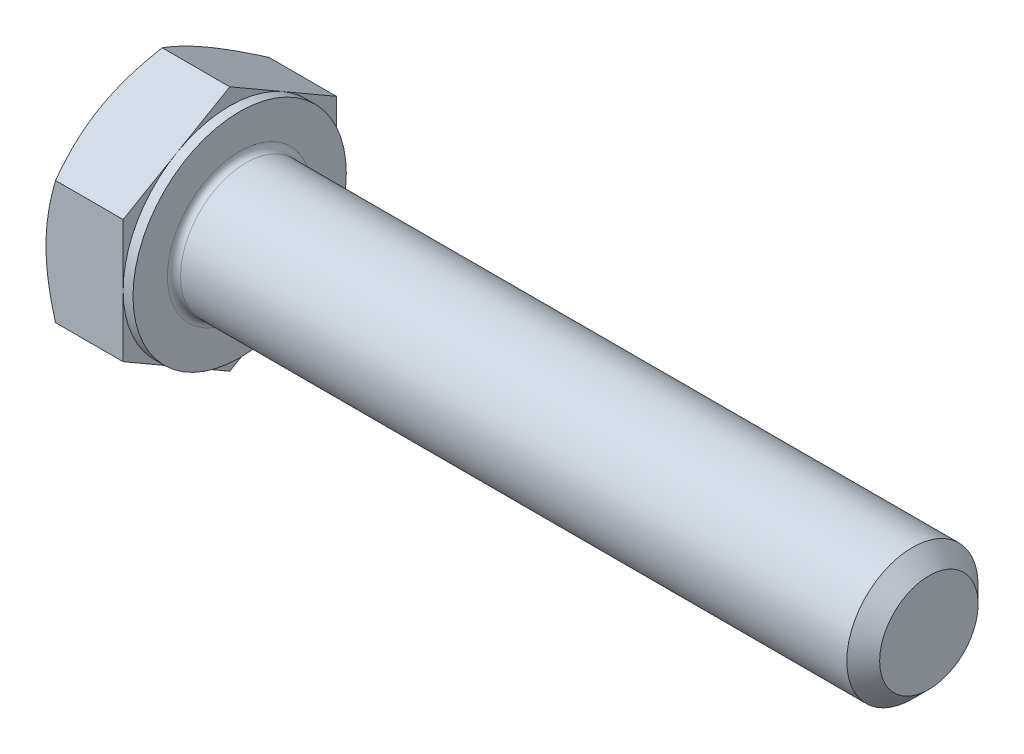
ISO-10303-21;
HEADER;
FILE_DESCRIPTION(('STEP AP214'),'2;1');
FILE_NAME('part.step','',(''),(''),'','','');
FILE_SCHEMA(('AUTOMOTIVE_DESIGN { 1 0 10303 214 1 1 1 1 }'));
ENDSEC;
DATA;
#1=APPLICATION_CONTEXT('core data for automotive mechanical design processes');
#2=APPLICATION_PROTOCOL_DEFINITION('international standard','automotive_design',2000,#1);
#3=PRODUCT_CONTEXT('',#1,'mechanical');
#4=PRODUCT('Part','Part','',(#3));
#5=PRODUCT_RELATED_PRODUCT_CATEGORY('part','',(#4));
#6=PRODUCT_DEFINITION_FORMATION('','',#4);
#7=PRODUCT_DEFINITION_CONTEXT('part definition',#1,'design');
#8=PRODUCT_DEFINITION('design','',#6,#7);
#9=PRODUCT_DEFINITION_SHAPE('','',#8);
#10=(LENGTH_UNIT() NAMED_UNIT(*) SI_UNIT(.MILLI.,.METRE.));
#11=(NAMED_UNIT(*) PLANE_ANGLE_UNIT() SI_UNIT($,.RADIAN.));
#12=(NAMED_UNIT(*) SI_UNIT($,.STERADIAN.) SOLID_ANGLE_UNIT());
#13=UNCERTAINTY_MEASURE_WITH_UNIT(LENGTH_MEASURE(1.E-05),#10,'distance_accuracy_value','');
#14=(GEOMETRIC_REPRESENTATION_CONTEXT(3) GLOBAL_UNCERTAINTY_ASSIGNED_CONTEXT((#13)) GLOBAL_UNIT_ASSIGNED_CONTEXT((#10,
#11,#12)) REPRESENTATION_CONTEXT('',''));
#15=CARTESIAN_POINT('',(0.,0.,0.));
#16=DIRECTION('',(0.,0.,1.));
#17=DIRECTION('',(1.,0.,0.));
#18=AXIS2_PLACEMENT_3D('',#15,#16,#17);
#19=CARTESIAN_POINT('',(5.3,3.75277674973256,-6.5));
#20=DIRECTION('',(0.,-0.866025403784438,0.500000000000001));
#21=DIRECTION('',(0.,-0.500000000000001,-0.866025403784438));
#22=AXIS2_PLACEMENT_3D('',#19,#20,#21);
#23=PLANE('',#22);
#24=DIRECTION('',(0.,0.500000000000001,0.866025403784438));
#25=VECTOR('',#24,1.);
#26=CARTESIAN_POINT('',(4.7,3.75277674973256,-6.5));
#27=LINE('',#26,#25);
#28=CARTESIAN_POINT('',(4.7,3.75277674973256,-6.5));
#29=VERTEX_POINT('',#28);
#30=CARTESIAN_POINT('',(4.7,5.62916512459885,-3.25000000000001));
#31=VERTEX_POINT('',#30);
#32=EDGE_CURVE('E173',#29,#31,#27,.T.);
#33=ORIENTED_EDGE('',*,*,#32,.F.);
#34=DIRECTION('',(-1.,0.,0.));
#35=VECTOR('',#34,1.);
#36=CARTESIAN_POINT('',(5.3,3.75277674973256,-6.5));
#37=LINE('',#36,#35);
#38=CARTESIAN_POINT('',(0.580556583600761,3.75277674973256,-6.5));
#39=VERTEX_POINT('',#38);
#40=EDGE_CURVE('E301',#29,#39,#37,.T.);
#41=ORIENTED_EDGE('',*,*,#40,.T.);
#42=CARTESIAN_POINT('',(0.580623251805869,7.50566896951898,0.000200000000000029));
#43=CARTESIAN_POINT('',(0.533004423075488,7.4231786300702,-0.14267745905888));
#44=CARTESIAN_POINT('',(0.487546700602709,7.34038072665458,-0.286087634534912));
#45=CARTESIAN_POINT('',(0.401548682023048,7.17411251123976,-0.574072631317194));
#46=CARTESIAN_POINT('',(0.361010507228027,7.09064192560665,-0.718647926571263));
#47=CARTESIAN_POINT('',(0.24757100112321,6.83889369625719,-1.15468865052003));
#48=CARTESIAN_POINT('',(0.183047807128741,6.66962231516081,-1.44787528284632));
#49=CARTESIAN_POINT('',(0.107386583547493,6.41631077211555,-1.88662374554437));
#50=CARTESIAN_POINT('',(0.0858328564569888,6.33302748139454,-2.03087463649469));
#51=CARTESIAN_POINT('',(0.04969031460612,6.16608458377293,-2.32002821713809));
#52=CARTESIAN_POINT('',(0.0351008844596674,6.08242501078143,-2.46493084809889));
#53=CARTESIAN_POINT('',(0.0132587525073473,5.91496056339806,-2.75498777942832));
#54=CARTESIAN_POINT('',(0.0059977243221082,5.8311559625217,-2.90014160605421));
#55=CARTESIAN_POINT('',(-0.00103969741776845,5.66347396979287,-3.19057533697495));
#56=CARTESIAN_POINT('',(-0.000816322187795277,5.5795965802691,-3.33585523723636));
#57=CARTESIAN_POINT('',(0.010083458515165,5.34979921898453,-3.73387594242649));
#58=CARTESIAN_POINT('',(0.0283818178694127,5.20395446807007,-3.98648646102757));
#59=CARTESIAN_POINT('',(0.0864063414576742,4.91323365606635,-4.49002967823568));
#60=CARTESIAN_POINT('',(0.126152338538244,4.76835861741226,-4.74096060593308));
#61=CARTESIAN_POINT('',(0.225505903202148,4.47705272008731,-5.24551722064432));
#62=CARTESIAN_POINT('',(0.285534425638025,4.33065861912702,-5.49907924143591));
#63=CARTESIAN_POINT('',(0.421774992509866,4.04005357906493,-6.00242193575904));
#64=CARTESIAN_POINT('',(0.49795503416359,3.89583891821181,-6.25220905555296));
#65=CARTESIAN_POINT('',(0.580623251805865,3.75266127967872,-6.5002));
#66=B_SPLINE_CURVE_WITH_KNOTS('',3,(#42,#43,#44,#45,#46,#47,#48,#49,#50,#51,#52,#53,#54,#55,#56,
#57,#58,#59,#60,#61,#62,#63,#64,#65),.UNSPECIFIED.,.F.,.F.,(4,2,2,2,2,2,2,2,2,2,2,4),(0.,
0.515105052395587,1.03043143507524,2.06322554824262,2.56697389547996,3.07067772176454,
3.57380860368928,4.0769239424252,4.9527935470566,5.82947446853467,6.72559912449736,
7.61996451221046),.UNSPECIFIED.);
#67=CARTESIAN_POINT('',(0.,5.62916512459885,-3.25000000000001));
#68=VERTEX_POINT('',#67);
#69=EDGE_CURVE('E228',#68,#39,#66,.T.);
#70=ORIENTED_EDGE('',*,*,#69,.F.);
#71=CARTESIAN_POINT('',(0.580556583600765,7.50555349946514,0.));
#72=VERTEX_POINT('',#71);
#73=EDGE_CURVE('E64',#72,#68,#66,.T.);
#74=ORIENTED_EDGE('',*,*,#73,.F.);
#75=DIRECTION('',(-1.,0.,0.));
#76=VECTOR('',#75,1.);
#77=CARTESIAN_POINT('',(5.3,7.50555349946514,0.));
#78=LINE('',#77,#76);
#79=CARTESIAN_POINT('',(4.7,7.50555349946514,0.));
#80=VERTEX_POINT('',#79);
#81=EDGE_CURVE('E293',#80,#72,#78,.T.);
#82=ORIENTED_EDGE('',*,*,#81,.F.);
#83=EDGE_CURVE('E171',#31,#80,#27,.T.);
#84=ORIENTED_EDGE('',*,*,#83,.F.);
#85=EDGE_LOOP('',(#33,#41,#70,#74,#82,#84));
#86=FACE_BOUND('',#85,.T.);
#87=ADVANCED_FACE('F41',(#86),#23,.F.);
#88=CARTESIAN_POINT('',(5.3,7.50555349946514,0.));
#89=DIRECTION('',(0.,-0.866025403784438,-0.500000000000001));
#90=DIRECTION('',(0.,0.500000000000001,-0.866025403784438));
#91=AXIS2_PLACEMENT_3D('',#88,#89,#90);
#92=PLANE('',#91);
#93=DIRECTION('',(0.,-0.500000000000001,0.866025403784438));
#94=VECTOR('',#93,1.);
#95=CARTESIAN_POINT('',(4.7,7.50555349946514,0.));
#96=LINE('',#95,#94);
#97=CARTESIAN_POINT('',(4.7,5.62916512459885,3.25000000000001));
#98=VERTEX_POINT('',#97);
#99=EDGE_CURVE('E170',#80,#98,#96,.T.);
#100=ORIENTED_EDGE('',*,*,#99,.F.);
#101=ORIENTED_EDGE('',*,*,#81,.T.);
#102=CARTESIAN_POINT('',(0.580623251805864,3.75266127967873,6.50019999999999));
#103=CARTESIAN_POINT('',(0.533004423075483,3.83515161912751,6.35732254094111));
#104=CARTESIAN_POINT('',(0.487546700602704,3.91794952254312,6.21391236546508));
#105=CARTESIAN_POINT('',(0.401548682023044,4.08421773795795,5.9259273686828));
#106=CARTESIAN_POINT('',(0.361010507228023,4.16768832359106,5.78135207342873));
#107=CARTESIAN_POINT('',(0.247571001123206,4.41943655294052,5.34531134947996));
#108=CARTESIAN_POINT('',(0.183047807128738,4.5887079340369,5.05212471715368));
#109=CARTESIAN_POINT('',(0.107386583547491,4.84201947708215,4.61337625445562));
#110=CARTESIAN_POINT('',(0.0858328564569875,4.92530276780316,4.4691253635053));
#111=CARTESIAN_POINT('',(0.0496903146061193,5.09224566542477,4.17997178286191));
#112=CARTESIAN_POINT('',(0.035100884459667,5.17590523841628,4.03506915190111));
#113=CARTESIAN_POINT('',(0.0132587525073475,5.34336968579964,3.74501222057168));
#114=CARTESIAN_POINT('',(0.00599772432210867,5.427174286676,3.59985839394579));
#115=CARTESIAN_POINT('',(-0.00103969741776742,5.59485627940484,3.30942466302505));
#116=CARTESIAN_POINT('',(-0.000816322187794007,5.67873366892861,3.16414476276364));
#117=CARTESIAN_POINT('',(0.0100834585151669,5.90853103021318,2.7661240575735));
#118=CARTESIAN_POINT('',(0.0283818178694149,6.05437578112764,2.51351353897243));
#119=CARTESIAN_POINT('',(0.0864063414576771,6.34509659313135,2.00997032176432));
#120=CARTESIAN_POINT('',(0.126152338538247,6.48997163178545,1.75903939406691));
#121=CARTESIAN_POINT('',(0.225505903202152,6.78127752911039,1.25448277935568));
#122=CARTESIAN_POINT('',(0.285534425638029,6.92767163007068,1.00092075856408));
#123=CARTESIAN_POINT('',(0.421774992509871,7.21827667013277,0.497578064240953));
#124=CARTESIAN_POINT('',(0.497955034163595,7.36249133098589,0.247790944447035));
#125=CARTESIAN_POINT('',(0.58062325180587,7.50566896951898,-0.000200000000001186));
#126=B_SPLINE_CURVE_WITH_KNOTS('',3,(#102,#103,#104,#105,#106,#107,#108,#109,#110,#111,#112,
#113,#114,#115,#116,#117,#118,#119,#120,#121,#122,#123,#124,#125),.UNSPECIFIED.,.F.,.F.,(4,2,2,
2,2,2,2,2,2,2,2,4),(0.,0.515105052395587,1.03043143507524,2.06322554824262,2.56697389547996,
3.07067772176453,3.57380860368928,4.0769239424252,4.9527935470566,5.82947446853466,
6.72559912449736,7.61996451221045),.UNSPECIFIED.);
#127=CARTESIAN_POINT('',(0.,5.62916512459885,3.25));
#128=VERTEX_POINT('',#127);
#129=EDGE_CURVE('E225',#128,#72,#126,.T.);
#130=ORIENTED_EDGE('',*,*,#129,.F.);
#131=CARTESIAN_POINT('',(0.58055658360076,3.75277674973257,6.49999999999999));
#132=VERTEX_POINT('',#131);
#133=EDGE_CURVE('E239',#132,#128,#126,.T.);
#134=ORIENTED_EDGE('',*,*,#133,.F.);
#135=DIRECTION('',(-1.,0.,0.));
#136=VECTOR('',#135,1.);
#137=CARTESIAN_POINT('',(5.3,3.75277674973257,6.49999999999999));
#138=LINE('',#137,#136);
#139=CARTESIAN_POINT('',(4.7,3.75277674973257,6.49999999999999));
#140=VERTEX_POINT('',#139);
#141=EDGE_CURVE('E295',#140,#132,#138,.T.);
#142=ORIENTED_EDGE('',*,*,#141,.F.);
#143=EDGE_CURVE('E138',#98,#140,#96,.T.);
#144=ORIENTED_EDGE('',*,*,#143,.F.);
#145=EDGE_LOOP('',(#100,#101,#130,#134,#142,#144));
#146=FACE_BOUND('',#145,.T.);
#147=ADVANCED_FACE('F246',(#146),#92,.F.);
#148=CARTESIAN_POINT('',(5.3,3.75277674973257,6.49999999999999));
#149=DIRECTION('',(0.,0.,-1.));
#150=DIRECTION('',(0.,1.,0.));
#151=AXIS2_PLACEMENT_3D('',#148,#149,#150);
#152=PLANE('',#151);
#153=DIRECTION('',(0.,-1.,0.));
#154=VECTOR('',#153,1.);
#155=CARTESIAN_POINT('',(4.7,3.75277674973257,6.49999999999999));
#156=LINE('',#155,#154);
#157=CARTESIAN_POINT('',(4.7,0.,6.5));
#158=VERTEX_POINT('',#157);
#159=EDGE_CURVE('E132',#140,#158,#156,.T.);
#160=ORIENTED_EDGE('',*,*,#159,.F.);
#161=ORIENTED_EDGE('',*,*,#141,.T.);
#162=CARTESIAN_POINT('',(3.18835311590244,-10.1137456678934,6.5));
#163=CARTESIAN_POINT('',(3.05034774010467,-9.82952666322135,6.5));
#164=CARTESIAN_POINT('',(2.91365616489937,-9.54465869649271,6.5));
#165=CARTESIAN_POINT('',(2.6436389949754,-8.97327978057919,6.5));
#166=CARTESIAN_POINT('',(2.51031392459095,-8.6867685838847,6.5));
#167=CARTESIAN_POINT('',(2.24710473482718,-8.11029837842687,6.5));
#168=CARTESIAN_POINT('',(2.11724300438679,-7.82032911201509,6.5));
#169=CARTESIAN_POINT('',(1.86279082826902,-7.23809541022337,6.5));
#170=CARTESIAN_POINT('',(1.73820013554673,-6.94583108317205,6.5));
#171=CARTESIAN_POINT('',(1.4917668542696,-6.34906440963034,6.5));
#172=CARTESIAN_POINT('',(1.37014257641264,-6.0444714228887,6.5));
#173=CARTESIAN_POINT('',(1.13601865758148,-5.43173420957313,6.5));
#174=CARTESIAN_POINT('',(1.02352003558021,-5.12358959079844,6.5));
#175=CARTESIAN_POINT('',(0.81057536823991,-4.50382569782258,6.5));
#176=CARTESIAN_POINT('',(0.710105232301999,-4.19221478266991,6.5));
#177=CARTESIAN_POINT('',(0.524420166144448,-3.5645201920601,6.5));
#178=CARTESIAN_POINT('',(0.439200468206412,-3.24843794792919,6.5));
#179=CARTESIAN_POINT('',(0.288524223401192,-2.61335465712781,6.5));
#180=CARTESIAN_POINT('',(0.222961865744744,-2.29437912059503,6.5));
#181=CARTESIAN_POINT('',(0.115312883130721,-1.65238219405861,6.5));
#182=CARTESIAN_POINT('',(0.07322390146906,-1.32936121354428,6.5));
#183=CARTESIAN_POINT('',(0.0304887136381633,-0.845231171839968,6.5));
#184=CARTESIAN_POINT('',(0.0196493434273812,-0.684982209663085,6.5));
#185=CARTESIAN_POINT('',(0.00475298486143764,-0.364162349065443,6.5));
#186=CARTESIAN_POINT('',(0.000695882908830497,-0.203591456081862,6.5));
#187=CARTESIAN_POINT('',(-0.000531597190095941,0.117577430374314,6.5));
#188=CARTESIAN_POINT('',(0.002298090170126,0.278175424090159,6.5));
#189=CARTESIAN_POINT('',(0.0147726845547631,0.599108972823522,6.5));
#190=CARTESIAN_POINT('',(0.0244179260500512,0.759444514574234,6.5));
#191=CARTESIAN_POINT('',(0.0554961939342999,1.14369946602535,6.5));
#192=CARTESIAN_POINT('',(0.080103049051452,1.36736763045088,6.49999999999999));
#193=CARTESIAN_POINT('',(0.141246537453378,1.81305591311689,6.49999999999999));
#194=CARTESIAN_POINT('',(0.177784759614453,2.0350758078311,6.49999999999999));
#195=CARTESIAN_POINT('',(0.303360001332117,2.69839633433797,6.49999999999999));
#196=CARTESIAN_POINT('',(0.408335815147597,3.13672010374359,6.49999999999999));
#197=CARTESIAN_POINT('',(0.590564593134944,3.7923211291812,6.49999999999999));
#198=CARTESIAN_POINT('',(0.656313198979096,4.01299150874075,6.49999999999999));
#199=CARTESIAN_POINT('',(0.794681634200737,4.45218859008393,6.49999999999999));
#200=CARTESIAN_POINT('',(0.867301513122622,4.67071527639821,6.49999999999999));
#201=CARTESIAN_POINT('',(1.01824353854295,5.10569490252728,6.49999999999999));
#202=CARTESIAN_POINT('',(1.09656388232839,5.32214847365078,6.49999999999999));
#203=CARTESIAN_POINT('',(1.25798086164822,5.75325725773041,6.49999999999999));
#204=CARTESIAN_POINT('',(1.34107741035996,5.96791250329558,6.49999999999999));
#205=CARTESIAN_POINT('',(1.56029019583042,6.51888445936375,6.49999999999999));
#206=CARTESIAN_POINT('',(1.69936356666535,6.85402316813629,6.49999999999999));
#207=CARTESIAN_POINT('',(1.98501958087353,7.52109583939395,6.49999999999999));
#208=CARTESIAN_POINT('',(2.13160288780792,7.85302951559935,6.49999999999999));
#209=CARTESIAN_POINT('',(2.43059748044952,8.51437865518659,6.49999999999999));
#210=CARTESIAN_POINT('',(2.5830105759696,8.84379329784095,6.49999999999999));
#211=CARTESIAN_POINT('',(2.89234869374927,9.50047798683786,6.49999999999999));
#212=CARTESIAN_POINT('',(3.04927357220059,9.82774810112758,6.49999999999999));
#213=CARTESIAN_POINT('',(3.36692013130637,10.4809971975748,6.49999999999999));
#214=CARTESIAN_POINT('',(3.52764676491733,10.8069737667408,6.49999999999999));
#215=CARTESIAN_POINT('',(3.851985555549,11.4574882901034,6.49999999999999));
#216=CARTESIAN_POINT('',(4.01559773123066,11.7820262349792,6.49999999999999));
#217=CARTESIAN_POINT('',(4.50986185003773,12.7537468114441,6.49999999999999));
#218=CARTESIAN_POINT('',(4.84399997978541,13.3991555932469,6.49999999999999));
#219=CARTESIAN_POINT('',(5.48575990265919,14.6239779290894,6.49999999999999));
#220=CARTESIAN_POINT('',(5.79279643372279,15.2036995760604,6.49999999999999));
#221=CARTESIAN_POINT('',(6.4106918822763,16.3611382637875,6.49999999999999));
#222=CARTESIAN_POINT('',(6.72155099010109,16.938855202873,6.49999999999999));
#223=CARTESIAN_POINT('',(7.34519775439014,18.0910273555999,6.49999999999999));
#224=CARTESIAN_POINT('',(7.65797694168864,18.665487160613,6.49999999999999));
#225=CARTESIAN_POINT('',(8.28574397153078,19.8131486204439,6.49999999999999));
#226=CARTESIAN_POINT('',(8.60073166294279,20.3863503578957,6.49999999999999));
#227=CARTESIAN_POINT('',(8.91652967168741,20.9591024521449,6.49999999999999));
#228=B_SPLINE_CURVE_WITH_KNOTS('',3,(#162,#163,#164,#165,#166,#167,#168,#169,#170,#171,#172,
#173,#174,#175,#176,#177,#178,#179,#180,#181,#182,#183,#184,#185,#186,#187,#188,#189,#190,#191,
#192,#193,#194,#195,#196,#197,#198,#199,#200,#201,#202,#203,#204,#205,#206,#207,#208,#209,#210,
#211,#212,#213,#214,#215,#216,#217,#218,#219,#220,#221,#222,#223,#224,#225,#226,#227),
.UNSPECIFIED.,.F.,.F.,(4,2,2,2,2,2,2,2,2,2,2,2,2,2,2,2,2,2,2,2,2,2,2,2,2,2,2,2,2,2,2,2,4),(0.,
0.947868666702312,1.89588406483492,2.84900320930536,3.80207763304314,4.7858977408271,
5.76982755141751,6.75175256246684,7.73337005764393,8.7096047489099,9.68574140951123,
10.1674651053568,10.6491807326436,11.1309009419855,11.6126447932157,12.287317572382,
12.9620802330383,14.3123184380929,15.0030310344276,15.6937486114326,16.384248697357,
17.0747362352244,18.1631508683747,19.2516618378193,20.3405135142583,21.4293305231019,
22.5196540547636,23.6099846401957,25.7902468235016,27.7582608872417,29.7263733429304,
31.6886408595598,33.6507753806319),.UNSPECIFIED.);
#229=CARTESIAN_POINT('',(0.,0.,6.5));
#230=VERTEX_POINT('',#229);
#231=EDGE_CURVE('E240',#230,#132,#228,.T.);
#232=ORIENTED_EDGE('',*,*,#231,.F.);
#233=CARTESIAN_POINT('',(0.580556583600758,-3.75277674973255,6.5));
#234=VERTEX_POINT('',#233);
#235=EDGE_CURVE('E302',#234,#230,#228,.T.);
#236=ORIENTED_EDGE('',*,*,#235,.F.);
#237=DIRECTION('',(-1.,0.,0.));
#238=VECTOR('',#237,1.);
#239=CARTESIAN_POINT('',(5.3,-3.75277674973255,6.5));
#240=LINE('',#239,#238);
#241=CARTESIAN_POINT('',(4.7,-3.75277674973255,6.5));
#242=VERTEX_POINT('',#241);
#243=EDGE_CURVE('E164',#242,#234,#240,.T.);
#244=ORIENTED_EDGE('',*,*,#243,.F.);
#245=EDGE_CURVE('E142',#158,#242,#156,.T.);
#246=ORIENTED_EDGE('',*,*,#245,.F.);
#247=EDGE_LOOP('',(#160,#161,#232,#236,#244,#246));
#248=FACE_BOUND('',#247,.T.);
#249=ADVANCED_FACE('F162',(#248),#152,.F.);
#250=CARTESIAN_POINT('',(5.3,-7.50555349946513,0.));
#251=DIRECTION('',(0.,0.866025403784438,-0.500000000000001));
#252=DIRECTION('',(0.,0.500000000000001,0.866025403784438));
#253=AXIS2_PLACEMENT_3D('',#250,#251,#252);
#254=PLANE('',#253);
#255=DIRECTION('',(0.,-0.500000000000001,-0.866025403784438));
#256=VECTOR('',#255,1.);
#257=CARTESIAN_POINT('',(4.7,-7.50555349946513,0.));
#258=LINE('',#257,#256);
#259=CARTESIAN_POINT('',(4.7,-5.62916512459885,3.25000000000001));
#260=VERTEX_POINT('',#259);
#261=EDGE_CURVE('E149',#242,#260,#258,.T.);
#262=ORIENTED_EDGE('',*,*,#261,.F.);
#263=ORIENTED_EDGE('',*,*,#243,.T.);
#264=CARTESIAN_POINT('',(0.580623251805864,-7.50566896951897,-0.000199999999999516));
#265=CARTESIAN_POINT('',(0.533004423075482,-7.42317863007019,0.142677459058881));
#266=CARTESIAN_POINT('',(0.487546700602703,-7.34038072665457,0.286087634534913));
#267=CARTESIAN_POINT('',(0.401548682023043,-7.17411251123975,0.574072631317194));
#268=CARTESIAN_POINT('',(0.361010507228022,-7.09064192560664,0.718647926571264));
#269=CARTESIAN_POINT('',(0.247571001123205,-6.83889369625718,1.15468865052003));
#270=CARTESIAN_POINT('',(0.183047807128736,-6.6696223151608,1.44787528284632));
#271=CARTESIAN_POINT('',(0.107386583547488,-6.41631077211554,1.88662374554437));
#272=CARTESIAN_POINT('',(0.0858328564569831,-6.33302748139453,2.03087463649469));
#273=CARTESIAN_POINT('',(0.0496903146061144,-6.16608458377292,2.32002821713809));
#274=CARTESIAN_POINT('',(0.0351008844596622,-6.08242501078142,2.46493084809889));
#275=CARTESIAN_POINT('',(0.0132587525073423,-5.91496056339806,2.75498777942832));
#276=CARTESIAN_POINT('',(0.0059977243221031,-5.83115596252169,2.90014160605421));
#277=CARTESIAN_POINT('',(-0.0010396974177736,-5.66347396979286,3.19057533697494));
#278=CARTESIAN_POINT('',(-0.000816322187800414,-5.57959658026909,3.33585523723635));
#279=CARTESIAN_POINT('',(0.0100834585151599,-5.34979921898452,3.73387594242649));
#280=CARTESIAN_POINT('',(0.0283818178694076,-5.20395446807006,3.98648646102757));
#281=CARTESIAN_POINT('',(0.0864063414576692,-4.91323365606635,4.49002967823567));
#282=CARTESIAN_POINT('',(0.126152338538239,-4.76835861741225,4.74096060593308));
#283=CARTESIAN_POINT('',(0.225505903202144,-4.4770527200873,5.24551722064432));
#284=CARTESIAN_POINT('',(0.285534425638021,-4.33065861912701,5.49907924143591));
#285=CARTESIAN_POINT('',(0.421774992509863,-4.04005357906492,6.00242193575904));
#286=CARTESIAN_POINT('',(0.497955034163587,-3.8958389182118,6.25220905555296));
#287=CARTESIAN_POINT('',(0.580623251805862,-3.75266127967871,6.5002));
#288=B_SPLINE_CURVE_WITH_KNOTS('',3,(#264,#265,#266,#267,#268,#269,#270,#271,#272,#273,#274,
#275,#276,#277,#278,#279,#280,#281,#282,#283,#284,#285,#286,#287),.UNSPECIFIED.,.F.,.F.,(4,2,2,
2,2,2,2,2,2,2,2,4),(0.,0.515105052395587,1.03043143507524,2.06322554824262,2.56697389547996,
3.07067772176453,3.57380860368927,4.0769239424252,4.9527935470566,5.82947446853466,
6.72559912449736,7.61996451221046),.UNSPECIFIED.);
#289=CARTESIAN_POINT('',(0.,-5.62916512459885,3.25000000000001));
#290=VERTEX_POINT('',#289);
#291=EDGE_CURVE('E227',#290,#234,#288,.T.);
#292=ORIENTED_EDGE('',*,*,#291,.F.);
#293=CARTESIAN_POINT('',(0.580556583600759,-7.50555349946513,0.));
#294=VERTEX_POINT('',#293);
#295=EDGE_CURVE('E219',#294,#290,#288,.T.);
#296=ORIENTED_EDGE('',*,*,#295,.F.);
#297=DIRECTION('',(-1.,0.,0.));
#298=VECTOR('',#297,1.);
#299=CARTESIAN_POINT('',(5.3,-7.50555349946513,0.));
#300=LINE('',#299,#298);
#301=CARTESIAN_POINT('',(4.7,-7.50555349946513,0.));
#302=VERTEX_POINT('',#301);
#303=EDGE_CURVE('E298',#302,#294,#300,.T.);
#304=ORIENTED_EDGE('',*,*,#303,.F.);
#305=EDGE_CURVE('E165',#260,#302,#258,.T.);
#306=ORIENTED_EDGE('',*,*,#305,.F.);
#307=EDGE_LOOP('',(#262,#263,#292,#296,#304,#306));
#308=FACE_BOUND('',#307,.T.);
#309=ADVANCED_FACE('F210',(#308),#254,.F.);
#310=CARTESIAN_POINT('',(5.3,-3.75277674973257,-6.5));
#311=DIRECTION('',(0.,0.866025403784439,0.499999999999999));
#312=DIRECTION('',(0.,-0.499999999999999,0.866025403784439));
#313=AXIS2_PLACEMENT_3D('',#310,#311,#312);
#314=PLANE('',#313);
#315=DIRECTION('',(0.,0.499999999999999,-0.866025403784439));
#316=VECTOR('',#315,1.);
#317=CARTESIAN_POINT('',(4.7,-3.75277674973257,-6.5));
#318=LINE('',#317,#316);
#319=CARTESIAN_POINT('',(4.7,-5.62916512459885,-3.25));
#320=VERTEX_POINT('',#319);
#321=EDGE_CURVE('E348',#302,#320,#318,.T.);
#322=ORIENTED_EDGE('',*,*,#321,.F.);
#323=ORIENTED_EDGE('',*,*,#303,.T.);
#324=CARTESIAN_POINT('',(0.580623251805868,-3.75266127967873,-6.5002));
#325=CARTESIAN_POINT('',(0.533004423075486,-3.8351516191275,-6.35732254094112));
#326=CARTESIAN_POINT('',(0.487546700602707,-3.91794952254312,-6.21391236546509));
#327=CARTESIAN_POINT('',(0.401548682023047,-4.08421773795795,-5.92592736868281));
#328=CARTESIAN_POINT('',(0.361010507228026,-4.16768832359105,-5.78135207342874));
#329=CARTESIAN_POINT('',(0.247571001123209,-4.41943655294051,-5.34531134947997));
#330=CARTESIAN_POINT('',(0.183047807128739,-4.5887079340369,-5.05212471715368));
#331=CARTESIAN_POINT('',(0.107386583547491,-4.84201947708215,-4.61337625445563));
#332=CARTESIAN_POINT('',(0.0858328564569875,-4.92530276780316,-4.46912536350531));
#333=CARTESIAN_POINT('',(0.0496903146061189,-5.09224566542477,-4.17997178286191));
#334=CARTESIAN_POINT('',(0.0351008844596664,-5.17590523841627,-4.03506915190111));
#335=CARTESIAN_POINT('',(0.0132587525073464,-5.34336968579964,-3.74501222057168));
#336=CARTESIAN_POINT('',(0.00599772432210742,-5.427174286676,-3.59985839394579));
#337=CARTESIAN_POINT('',(-0.00103969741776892,-5.59485627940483,-3.30942466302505));
#338=CARTESIAN_POINT('',(-0.000816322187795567,-5.6787336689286,-3.16414476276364));
#339=CARTESIAN_POINT('',(0.0100834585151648,-5.90853103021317,-2.7661240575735));
#340=CARTESIAN_POINT('',(0.0283818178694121,-6.05437578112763,-2.51351353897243));
#341=CARTESIAN_POINT('',(0.0864063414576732,-6.34509659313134,-2.00997032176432));
#342=CARTESIAN_POINT('',(0.126152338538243,-6.48997163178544,-1.75903939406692));
#343=CARTESIAN_POINT('',(0.225505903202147,-6.78127752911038,-1.25448277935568));
#344=CARTESIAN_POINT('',(0.285534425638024,-6.92767163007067,-1.00092075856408));
#345=CARTESIAN_POINT('',(0.421774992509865,-7.21827667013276,-0.497578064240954));
#346=CARTESIAN_POINT('',(0.49795503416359,-7.36249133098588,-0.247790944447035));
#347=CARTESIAN_POINT('',(0.580623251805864,-7.50566896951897,0.00020000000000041));
#348=B_SPLINE_CURVE_WITH_KNOTS('',3,(#324,#325,#326,#327,#328,#329,#330,#331,#332,#333,#334,
#335,#336,#337,#338,#339,#340,#341,#342,#343,#344,#345,#346,#347),.UNSPECIFIED.,.F.,.F.,(4,2,2,
2,2,2,2,2,2,2,2,4),(0.,0.515105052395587,1.03043143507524,2.06322554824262,2.56697389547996,
3.07067772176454,3.57380860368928,4.0769239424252,4.9527935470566,5.82947446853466,
6.72559912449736,7.61996451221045),.UNSPECIFIED.);
#349=CARTESIAN_POINT('',(0.,-5.62916512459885,-3.24999999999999));
#350=VERTEX_POINT('',#349);
#351=EDGE_CURVE('E226',#350,#294,#348,.T.);
#352=ORIENTED_EDGE('',*,*,#351,.F.);
#353=CARTESIAN_POINT('',(0.580556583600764,-3.75277674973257,-6.5));
#354=VERTEX_POINT('',#353);
#355=EDGE_CURVE('E187',#354,#350,#348,.T.);
#356=ORIENTED_EDGE('',*,*,#355,.F.);
#357=DIRECTION('',(-1.,0.,0.));
#358=VECTOR('',#357,1.);
#359=CARTESIAN_POINT('',(5.3,-3.75277674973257,-6.5));
#360=LINE('',#359,#358);
#361=CARTESIAN_POINT('',(4.7,-3.75277674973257,-6.5));
#362=VERTEX_POINT('',#361);
#363=EDGE_CURVE('E300',#362,#354,#360,.T.);
#364=ORIENTED_EDGE('',*,*,#363,.F.);
#365=EDGE_CURVE('E160',#320,#362,#318,.T.);
#366=ORIENTED_EDGE('',*,*,#365,.F.);
#367=EDGE_LOOP('',(#322,#323,#352,#356,#364,#366));
#368=FACE_BOUND('',#367,.T.);
#369=ADVANCED_FACE('F203',(#368),#314,.F.);
#370=CARTESIAN_POINT('',(5.3,3.75277674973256,-6.5));
#371=DIRECTION('',(0.,0.,1.));
#372=DIRECTION('',(0.,-1.,0.));
#373=AXIS2_PLACEMENT_3D('',#370,#371,#372);
#374=PLANE('',#373);
#375=DIRECTION('',(0.,1.,0.));
#376=VECTOR('',#375,1.);
#377=CARTESIAN_POINT('',(4.7,3.75277674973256,-6.5));
#378=LINE('',#377,#376);
#379=CARTESIAN_POINT('',(4.7,0.,-6.5));
#380=VERTEX_POINT('',#379);
#381=EDGE_CURVE('E272',#362,#380,#378,.T.);
#382=ORIENTED_EDGE('',*,*,#381,.F.);
#383=ORIENTED_EDGE('',*,*,#363,.T.);
#384=CARTESIAN_POINT('',(3.18835311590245,-10.1137456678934,-6.5));
#385=CARTESIAN_POINT('',(3.05034774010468,-9.82952666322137,-6.5));
#386=CARTESIAN_POINT('',(2.91365616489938,-9.54465869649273,-6.5));
#387=CARTESIAN_POINT('',(2.64363899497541,-8.97327978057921,-6.5));
#388=CARTESIAN_POINT('',(2.51031392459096,-8.68676858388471,-6.5));
#389=CARTESIAN_POINT('',(2.24710473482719,-8.11029837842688,-6.5));
#390=CARTESIAN_POINT('',(2.1172430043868,-7.82032911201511,-6.5));
#391=CARTESIAN_POINT('',(1.86279082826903,-7.23809541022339,-6.5));
#392=CARTESIAN_POINT('',(1.73820013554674,-6.94583108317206,-6.5));
#393=CARTESIAN_POINT('',(1.49176685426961,-6.34906440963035,-6.5));
#394=CARTESIAN_POINT('',(1.37014257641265,-6.04447142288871,-6.5));
#395=CARTESIAN_POINT('',(1.13601865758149,-5.43173420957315,-6.5));
#396=CARTESIAN_POINT('',(1.02352003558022,-5.12358959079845,-6.5));
#397=CARTESIAN_POINT('',(0.810575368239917,-4.50382569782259,-6.5));
#398=CARTESIAN_POINT('',(0.710105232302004,-4.19221478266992,-6.5));
#399=CARTESIAN_POINT('',(0.524420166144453,-3.56452019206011,-6.5));
#400=CARTESIAN_POINT('',(0.439200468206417,-3.2484379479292,-6.5));
#401=CARTESIAN_POINT('',(0.288524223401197,-2.61335465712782,-6.5));
#402=CARTESIAN_POINT('',(0.222961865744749,-2.29437912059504,-6.5));
#403=CARTESIAN_POINT('',(0.115312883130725,-1.65238219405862,-6.5));
#404=CARTESIAN_POINT('',(0.0732239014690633,-1.32936121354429,-6.5));
#405=CARTESIAN_POINT('',(0.0304887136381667,-0.845231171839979,-6.5));
#406=CARTESIAN_POINT('',(0.0196493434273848,-0.684982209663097,-6.5));
#407=CARTESIAN_POINT('',(0.00475298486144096,-0.364162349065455,-6.5));
#408=CARTESIAN_POINT('',(0.000695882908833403,-0.203591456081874,-6.5));
#409=CARTESIAN_POINT('',(-0.000531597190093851,0.117577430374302,-6.5));
#410=CARTESIAN_POINT('',(0.00229809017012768,0.278175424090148,-6.5));
#411=CARTESIAN_POINT('',(0.0147726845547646,0.599108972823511,-6.5));
#412=CARTESIAN_POINT('',(0.0244179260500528,0.759444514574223,-6.5));
#413=CARTESIAN_POINT('',(0.0554961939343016,1.14369946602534,-6.5));
#414=CARTESIAN_POINT('',(0.0801030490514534,1.36736763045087,-6.5));
#415=CARTESIAN_POINT('',(0.141246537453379,1.81305591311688,-6.5));
#416=CARTESIAN_POINT('',(0.177784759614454,2.03507580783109,-6.5));
#417=CARTESIAN_POINT('',(0.303360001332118,2.69839633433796,-6.5));
#418=CARTESIAN_POINT('',(0.408335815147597,3.13672010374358,-6.5));
#419=CARTESIAN_POINT('',(0.590564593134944,3.79232112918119,-6.5));
#420=CARTESIAN_POINT('',(0.656313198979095,4.01299150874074,-6.5));
#421=CARTESIAN_POINT('',(0.794681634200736,4.45218859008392,-6.5));
#422=CARTESIAN_POINT('',(0.867301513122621,4.6707152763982,-6.5));
#423=CARTESIAN_POINT('',(1.01824353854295,5.10569490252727,-6.5));
#424=CARTESIAN_POINT('',(1.09656388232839,5.32214847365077,-6.5));
#425=CARTESIAN_POINT('',(1.25798086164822,5.7532572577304,-6.5));
#426=CARTESIAN_POINT('',(1.34107741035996,5.96791250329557,-6.5));
#427=CARTESIAN_POINT('',(1.56029019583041,6.51888445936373,-6.5));
#428=CARTESIAN_POINT('',(1.69936356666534,6.85402316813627,-6.5));
#429=CARTESIAN_POINT('',(1.98501958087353,7.52109583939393,-6.5));
#430=CARTESIAN_POINT('',(2.13160288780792,7.85302951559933,-6.5));
#431=CARTESIAN_POINT('',(2.43059748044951,8.51437865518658,-6.5));
#432=CARTESIAN_POINT('',(2.58301057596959,8.84379329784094,-6.5));
#433=CARTESIAN_POINT('',(2.89234869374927,9.50047798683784,-6.5));
#434=CARTESIAN_POINT('',(3.04927357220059,9.82774810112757,-6.5));
#435=CARTESIAN_POINT('',(3.36692013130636,10.4809971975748,-6.5));
#436=CARTESIAN_POINT('',(3.52764676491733,10.8069737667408,-6.5));
#437=CARTESIAN_POINT('',(3.85198555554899,11.4574882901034,-6.5));
#438=CARTESIAN_POINT('',(4.01559773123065,11.7820262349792,-6.5));
#439=CARTESIAN_POINT('',(4.50986185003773,12.753746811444,-6.5));
#440=CARTESIAN_POINT('',(4.8439999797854,13.3991555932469,-6.5));
#441=CARTESIAN_POINT('',(5.48575990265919,14.6239779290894,-6.5));
#442=CARTESIAN_POINT('',(5.79279643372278,15.2036995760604,-6.5));
#443=CARTESIAN_POINT('',(6.4106918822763,16.3611382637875,-6.5));
#444=CARTESIAN_POINT('',(6.72155099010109,16.938855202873,-6.5));
#445=CARTESIAN_POINT('',(7.34519775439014,18.0910273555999,-6.5));
#446=CARTESIAN_POINT('',(7.65797694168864,18.665487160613,-6.5));
#447=CARTESIAN_POINT('',(8.28574397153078,19.8131486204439,-6.5));
#448=CARTESIAN_POINT('',(8.60073166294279,20.3863503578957,-6.5));
#449=CARTESIAN_POINT('',(8.91652967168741,20.9591024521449,-6.49999999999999));
#450=B_SPLINE_CURVE_WITH_KNOTS('',3,(#384,#385,#386,#387,#388,#389,#390,#391,#392,#393,#394,
#395,#396,#397,#398,#399,#400,#401,#402,#403,#404,#405,#406,#407,#408,#409,#410,#411,#412,#413,
#414,#415,#416,#417,#418,#419,#420,#421,#422,#423,#424,#425,#426,#427,#428,#429,#430,#431,#432,
#433,#434,#435,#436,#437,#438,#439,#440,#441,#442,#443,#444,#445,#446,#447,#448,#449),
.UNSPECIFIED.,.F.,.F.,(4,2,2,2,2,2,2,2,2,2,2,2,2,2,2,2,2,2,2,2,2,2,2,2,2,2,2,2,2,2,2,2,4),(0.,
0.947868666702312,1.89588406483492,2.84900320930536,3.80207763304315,4.7858977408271,
5.76982755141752,6.75175256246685,7.73337005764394,8.70960474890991,9.68574140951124,
10.1674651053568,10.6491807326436,11.1309009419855,11.6126447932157,12.287317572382,
12.9620802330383,14.312318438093,15.0030310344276,15.6937486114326,16.3842486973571,
17.0747362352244,18.1631508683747,19.2516618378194,20.3405135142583,21.4293305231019,
22.5196540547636,23.6099846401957,25.7902468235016,27.7582608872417,29.7263733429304,
31.6886408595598,33.6507753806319),.UNSPECIFIED.);
#451=CARTESIAN_POINT('',(0.,0.,-6.5));
#452=VERTEX_POINT('',#451);
#453=EDGE_CURVE('E177',#452,#354,#450,.F.);
#454=ORIENTED_EDGE('',*,*,#453,.F.);
#455=EDGE_CURVE('E186',#39,#452,#450,.F.);
#456=ORIENTED_EDGE('',*,*,#455,.F.);
#457=ORIENTED_EDGE('',*,*,#40,.F.);
#458=EDGE_CURVE('E276',#380,#29,#378,.T.);
#459=ORIENTED_EDGE('',*,*,#458,.F.);
#460=EDGE_LOOP('',(#382,#383,#454,#456,#457,#459));
#461=FACE_BOUND('',#460,.T.);
#462=ADVANCED_FACE('F198',(#461),#374,.F.);
#463=CARTESIAN_POINT('',(0.,0.,0.));
#464=DIRECTION('',(1.,0.,0.));
#465=DIRECTION('',(0.,0.,-1.));
#466=AXIS2_PLACEMENT_3D('',#463,#464,#465);
#467=CONICAL_SURFACE('',#466,6.5,1.0471975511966);
#468=ORIENTED_EDGE('',*,*,#355,.T.);
#469=CARTESIAN_POINT('',(0.,0.,0.));
#470=DIRECTION('',(1.,0.,0.));
#471=DIRECTION('',(0.,0.,-1.));
#472=AXIS2_PLACEMENT_3D('',#469,#470,#471);
#473=CIRCLE('',#472,6.5);
#474=EDGE_CURVE('E289',#350,#452,#473,.T.);
#475=ORIENTED_EDGE('',*,*,#474,.T.);
#476=ORIENTED_EDGE('',*,*,#453,.T.);
#477=EDGE_LOOP('',(#468,#475,#476));
#478=FACE_BOUND('',#477,.T.);
#479=ADVANCED_FACE('F202',(#478),#467,.T.);
#480=ORIENTED_EDGE('',*,*,#295,.T.);
#481=EDGE_CURVE('E292',#290,#350,#473,.T.);
#482=ORIENTED_EDGE('',*,*,#481,.T.);
#483=ORIENTED_EDGE('',*,*,#351,.T.);
#484=EDGE_LOOP('',(#480,#482,#483));
#485=FACE_BOUND('',#484,.T.);
#486=ADVANCED_FACE('F345',(#485),#467,.T.);
#487=ORIENTED_EDGE('',*,*,#235,.T.);
#488=EDGE_CURVE('E322',#230,#290,#473,.T.);
#489=ORIENTED_EDGE('',*,*,#488,.T.);
#490=ORIENTED_EDGE('',*,*,#291,.T.);
#491=EDGE_LOOP('',(#487,#489,#490));
#492=FACE_BOUND('',#491,.T.);
#493=ADVANCED_FACE('F194',(#492),#467,.T.);
#494=ORIENTED_EDGE('',*,*,#231,.T.);
#495=ORIENTED_EDGE('',*,*,#133,.T.);
#496=CARTESIAN_POINT('',(0.,0.,0.));
#497=DIRECTION('',(-1.,0.,0.));
#498=DIRECTION('',(0.,0.,1.));
#499=AXIS2_PLACEMENT_3D('',#496,#497,#498);
#500=CIRCLE('',#499,6.5);
#501=EDGE_CURVE('E174',#230,#128,#500,.T.);
#502=ORIENTED_EDGE('',*,*,#501,.F.);
#503=EDGE_LOOP('',(#494,#495,#502));
#504=FACE_BOUND('',#503,.T.);
#505=ADVANCED_FACE('F316',(#504),#467,.T.);
#506=ORIENTED_EDGE('',*,*,#129,.T.);
#507=ORIENTED_EDGE('',*,*,#73,.T.);
#508=EDGE_CURVE('E287',#68,#128,#473,.T.);
#509=ORIENTED_EDGE('',*,*,#508,.T.);
#510=EDGE_LOOP('',(#506,#507,#509));
#511=FACE_BOUND('',#510,.T.);
#512=ADVANCED_FACE('F320',(#511),#467,.T.);
#513=ORIENTED_EDGE('',*,*,#69,.T.);
#514=ORIENTED_EDGE('',*,*,#455,.T.);
#515=EDGE_CURVE('E286',#452,#68,#473,.T.);
#516=ORIENTED_EDGE('',*,*,#515,.T.);
#517=EDGE_LOOP('',(#513,#514,#516));
#518=FACE_BOUND('',#517,.T.);
#519=ADVANCED_FACE('F336',(#518),#467,.T.);
#520=CARTESIAN_POINT('',(0.,7.50555349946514,0.));
#521=DIRECTION('',(1.,0.,0.));
#522=DIRECTION('',(0.,0.,-1.));
#523=AXIS2_PLACEMENT_3D('',#520,#521,#522);
#524=PLANE('',#523);
#525=ORIENTED_EDGE('',*,*,#515,.F.);
#526=ORIENTED_EDGE('',*,*,#474,.F.);
#527=ORIENTED_EDGE('',*,*,#481,.F.);
#528=ORIENTED_EDGE('',*,*,#488,.F.);
#529=ORIENTED_EDGE('',*,*,#501,.T.);
#530=ORIENTED_EDGE('',*,*,#508,.F.);
#531=EDGE_LOOP('',(#525,#526,#527,#528,#529,#530));
#532=FACE_BOUND('',#531,.T.);
#533=ADVANCED_FACE('F205',(#532),#524,.F.);
#534=CARTESIAN_POINT('',(4.7,6.5,0.));
#535=DIRECTION('',(1.,0.,0.));
#536=DIRECTION('',(0.,0.,-1.));
#537=AXIS2_PLACEMENT_3D('',#534,#535,#536);
#538=PLANE('',#537);
#539=ORIENTED_EDGE('',*,*,#32,.T.);
#540=CARTESIAN_POINT('',(4.7,0.,0.));
#541=DIRECTION('',(-1.,0.,0.));
#542=DIRECTION('',(0.,0.,1.));
#543=AXIS2_PLACEMENT_3D('',#540,#541,#542);
#544=CIRCLE('',#543,6.5);
#545=EDGE_CURVE('E56',#31,#380,#544,.T.);
#546=ORIENTED_EDGE('',*,*,#545,.T.);
#547=ORIENTED_EDGE('',*,*,#458,.T.);
#548=EDGE_LOOP('',(#539,#546,#547));
#549=FACE_BOUND('',#548,.T.);
#550=ADVANCED_FACE('F354',(#549),#538,.T.);
#551=ORIENTED_EDGE('',*,*,#83,.T.);
#552=ORIENTED_EDGE('',*,*,#99,.T.);
#553=EDGE_CURVE('E159',#98,#31,#544,.T.);
#554=ORIENTED_EDGE('',*,*,#553,.T.);
#555=EDGE_LOOP('',(#551,#552,#554));
#556=FACE_BOUND('',#555,.T.);
#557=ADVANCED_FACE('F356',(#556),#538,.T.);
#558=ORIENTED_EDGE('',*,*,#143,.T.);
#559=ORIENTED_EDGE('',*,*,#159,.T.);
#560=EDGE_CURVE('E136',#158,#98,#544,.T.);
#561=ORIENTED_EDGE('',*,*,#560,.T.);
#562=EDGE_LOOP('',(#558,#559,#561));
#563=FACE_BOUND('',#562,.T.);
#564=ADVANCED_FACE('F134',(#563),#538,.T.);
#565=ORIENTED_EDGE('',*,*,#245,.T.);
#566=ORIENTED_EDGE('',*,*,#261,.T.);
#567=EDGE_CURVE('E146',#260,#158,#544,.T.);
#568=ORIENTED_EDGE('',*,*,#567,.T.);
#569=EDGE_LOOP('',(#565,#566,#568));
#570=FACE_BOUND('',#569,.T.);
#571=ADVANCED_FACE('F147',(#570),#538,.T.);
#572=ORIENTED_EDGE('',*,*,#305,.T.);
#573=ORIENTED_EDGE('',*,*,#321,.T.);
#574=EDGE_CURVE('E153',#320,#260,#544,.T.);
#575=ORIENTED_EDGE('',*,*,#574,.T.);
#576=EDGE_LOOP('',(#572,#573,#575));
#577=FACE_BOUND('',#576,.T.);
#578=ADVANCED_FACE('F370',(#577),#538,.T.);
#579=ORIENTED_EDGE('',*,*,#365,.T.);
#580=ORIENTED_EDGE('',*,*,#381,.T.);
#581=EDGE_CURVE('E353',#380,#320,#544,.T.);
#582=ORIENTED_EDGE('',*,*,#581,.T.);
#583=EDGE_LOOP('',(#579,#580,#582));
#584=FACE_BOUND('',#583,.T.);
#585=ADVANCED_FACE('F351',(#584),#538,.T.);
#586=CARTESIAN_POINT('',(0.,0.,0.));
#587=DIRECTION('',(-1.,0.,0.));
#588=DIRECTION('',(0.,0.,1.));
#589=AXIS2_PLACEMENT_3D('',#586,#587,#588);
#590=CYLINDRICAL_SURFACE('',#589,6.5);
#591=ORIENTED_EDGE('',*,*,#545,.F.);
#592=ORIENTED_EDGE('',*,*,#553,.F.);
#593=ORIENTED_EDGE('',*,*,#560,.F.);
#594=ORIENTED_EDGE('',*,*,#567,.F.);
#595=ORIENTED_EDGE('',*,*,#574,.F.);
#596=ORIENTED_EDGE('',*,*,#581,.F.);
#597=EDGE_LOOP('',(#591,#592,#593,#594,#595,#596));
#598=FACE_BOUND('',#597,.T.);
#599=CARTESIAN_POINT('',(5.3,0.,0.));
#600=DIRECTION('',(1.,0.,0.));
#601=DIRECTION('',(0.,0.,-1.));
#602=AXIS2_PLACEMENT_3D('',#599,#600,#601);
#603=CIRCLE('',#602,6.5);
#604=CARTESIAN_POINT('',(5.3,0.,-6.5));
#605=VERTEX_POINT('',#604);
#606=EDGE_CURVE('E285',#605,#605,#603,.T.);
#607=ORIENTED_EDGE('',*,*,#606,.F.);
#608=EDGE_LOOP('',(#607));
#609=FACE_BOUND('',#608,.T.);
#610=ADVANCED_FACE('F156',(#598,#609),#590,.T.);
#611=CARTESIAN_POINT('',(47.3,0.,0.));
#612=DIRECTION('',(-1.,0.,0.));
#613=DIRECTION('',(0.,0.,1.));
#614=AXIS2_PLACEMENT_3D('',#611,#612,#613);
#615=PLANE('',#614);
#616=CARTESIAN_POINT('',(47.3,0.,0.));
#617=DIRECTION('',(-1.,0.,0.));
#618=DIRECTION('',(0.,0.,1.));
#619=AXIS2_PLACEMENT_3D('',#616,#617,#618);
#620=CIRCLE('',#619,3.);
#621=CARTESIAN_POINT('',(47.3,0.,3.));
#622=VERTEX_POINT('',#621);
#623=EDGE_CURVE('E267',#622,#622,#620,.F.);
#624=ORIENTED_EDGE('',*,*,#623,.T.);
#625=EDGE_LOOP('',(#624));
#626=FACE_BOUND('',#625,.T.);
#627=ADVANCED_FACE('F364',(#626),#615,.F.);
#628=CARTESIAN_POINT('',(0.,0.,0.));
#629=DIRECTION('',(-1.,0.,0.));
#630=DIRECTION('',(0.,0.,1.));
#631=AXIS2_PLACEMENT_3D('',#628,#629,#630);
#632=CYLINDRICAL_SURFACE('',#631,4.);
#633=CARTESIAN_POINT('',(5.7,0.,0.));
#634=DIRECTION('',(1.,0.,0.));
#635=DIRECTION('',(0.,0.,-1.));
#636=AXIS2_PLACEMENT_3D('',#633,#634,#635);
#637=CIRCLE('',#636,4.);
#638=CARTESIAN_POINT('',(5.7,0.,-4.));
#639=VERTEX_POINT('',#638);
#640=EDGE_CURVE('E12',#639,#639,#637,.T.);
#641=ORIENTED_EDGE('',*,*,#640,.T.);
#642=EDGE_LOOP('',(#641));
#643=FACE_BOUND('',#642,.T.);
#644=CARTESIAN_POINT('',(46.3,0.,0.));
#645=DIRECTION('',(-1.,0.,0.));
#646=DIRECTION('',(0.,0.,1.));
#647=AXIS2_PLACEMENT_3D('',#644,#645,#646);
#648=CIRCLE('',#647,4.);
#649=CARTESIAN_POINT('',(46.3,0.,4.));
#650=VERTEX_POINT('',#649);
#651=EDGE_CURVE('E270',#650,#650,#648,.T.);
#652=ORIENTED_EDGE('',*,*,#651,.T.);
#653=EDGE_LOOP('',(#652));
#654=FACE_BOUND('',#653,.T.);
#655=ADVANCED_FACE('F262',(#643,#654),#632,.T.);
#656=CARTESIAN_POINT('',(5.3,7.50555349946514,0.));
#657=DIRECTION('',(1.,0.,0.));
#658=DIRECTION('',(0.,0.,-1.));
#659=AXIS2_PLACEMENT_3D('',#656,#657,#658);
#660=PLANE('',#659);
#661=CARTESIAN_POINT('',(5.3,0.,0.));
#662=DIRECTION('',(1.,0.,0.));
#663=DIRECTION('',(0.,0.,-1.));
#664=AXIS2_PLACEMENT_3D('',#661,#662,#663);
#665=CIRCLE('',#664,4.4);
#666=CARTESIAN_POINT('',(5.3,0.,-4.4));
#667=VERTEX_POINT('',#666);
#668=EDGE_CURVE('E49',#667,#667,#665,.F.);
#669=ORIENTED_EDGE('',*,*,#668,.T.);
#670=EDGE_LOOP('',(#669));
#671=FACE_BOUND('',#670,.T.);
#672=ORIENTED_EDGE('',*,*,#606,.T.);
#673=EDGE_LOOP('',(#672));
#674=FACE_BOUND('',#673,.T.);
#675=ADVANCED_FACE('F255',(#671,#674),#660,.T.);
#676=CARTESIAN_POINT('',(46.3,0.,0.));
#677=DIRECTION('',(-1.,0.,0.));
#678=DIRECTION('',(0.,0.,1.));
#679=AXIS2_PLACEMENT_3D('',#676,#677,#678);
#680=CONICAL_SURFACE('',#679,4.,0.785398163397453);
#681=ORIENTED_EDGE('',*,*,#623,.F.);
#682=EDGE_LOOP('',(#681));
#683=FACE_BOUND('',#682,.T.);
#684=ORIENTED_EDGE('',*,*,#651,.F.);
#685=EDGE_LOOP('',(#684));
#686=FACE_BOUND('',#685,.T.);
#687=ADVANCED_FACE('F253',(#683,#686),#680,.T.);
#688=CARTESIAN_POINT('',(5.7,0.,0.));
#689=DIRECTION('',(1.,0.,0.));
#690=DIRECTION('',(0.,0.,-1.));
#691=AXIS2_PLACEMENT_3D('',#688,#689,#690);
#692=TOROIDAL_SURFACE('',#691,4.4,0.4);
#693=ORIENTED_EDGE('',*,*,#640,.F.);
#694=EDGE_LOOP('',(#693));
#695=FACE_BOUND('',#694,.T.);
#696=ORIENTED_EDGE('',*,*,#668,.F.);
#697=EDGE_LOOP('',(#696));
#698=FACE_BOUND('',#697,.T.);
#699=ADVANCED_FACE('F43',(#695,#698),#692,.F.);
#700=CLOSED_SHELL('',(#87,#147,#249,#309,#369,#462,#479,#486,#493,#505,#512,#519,#533,#550,#557,
#564,#571,#578,#585,#610,#627,#655,#675,#687,#699));
#701=MANIFOLD_SOLID_BREP('B2',#700);
#702=ADVANCED_BREP_SHAPE_REPRESENTATION('',(#18,#701),#14);
#703=SHAPE_DEFINITION_REPRESENTATION(#9,#702);
ENDSEC;
END-ISO-10303-21;
